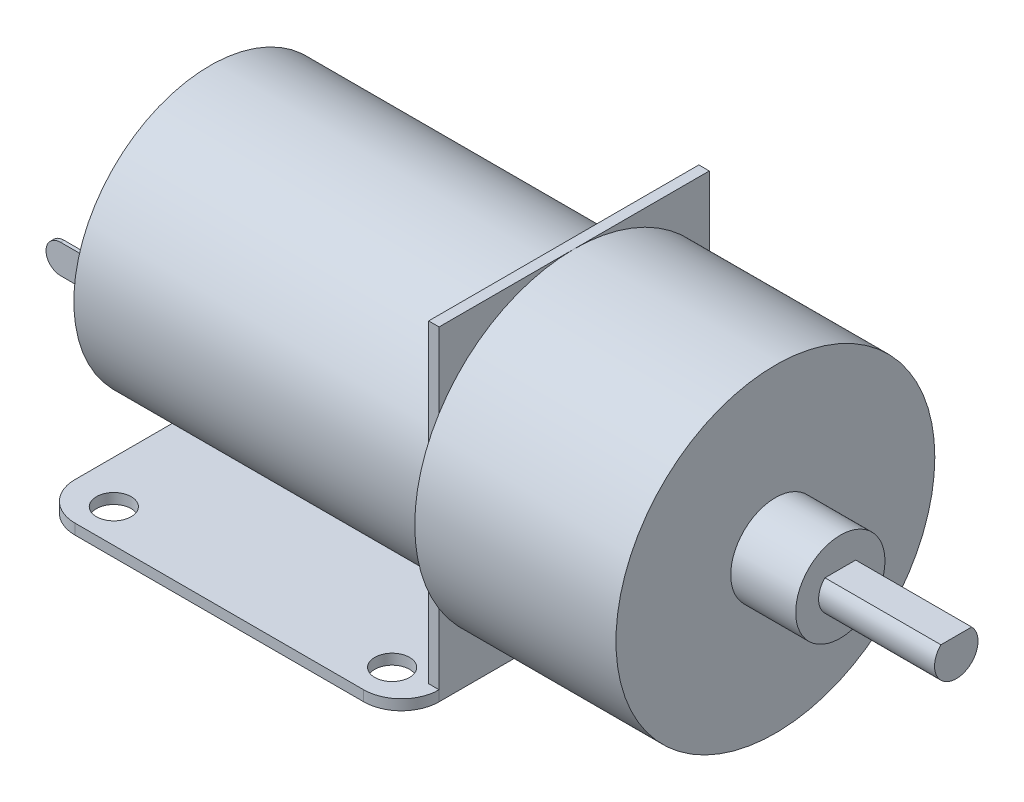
ISO-10303-21;
HEADER;
FILE_DESCRIPTION(('STEP AP214'),'2;1');
FILE_NAME('part.step','',(''),(''),'','','');
FILE_SCHEMA(('AUTOMOTIVE_DESIGN { 1 0 10303 214 1 1 1 1 }'));
ENDSEC;
DATA;
#1=APPLICATION_CONTEXT('core data for automotive mechanical design processes');
#2=APPLICATION_PROTOCOL_DEFINITION('international standard','automotive_design',2000,#1);
#3=PRODUCT_CONTEXT('',#1,'mechanical');
#4=PRODUCT('Part','Part','',(#3));
#5=PRODUCT_RELATED_PRODUCT_CATEGORY('part','',(#4));
#6=PRODUCT_DEFINITION_FORMATION('','',#4);
#7=PRODUCT_DEFINITION_CONTEXT('part definition',#1,'design');
#8=PRODUCT_DEFINITION('design','',#6,#7);
#9=PRODUCT_DEFINITION_SHAPE('','',#8);
#10=(LENGTH_UNIT() NAMED_UNIT(*) SI_UNIT(.MILLI.,.METRE.));
#11=(NAMED_UNIT(*) PLANE_ANGLE_UNIT() SI_UNIT($,.RADIAN.));
#12=(NAMED_UNIT(*) SI_UNIT($,.STERADIAN.) SOLID_ANGLE_UNIT());
#13=UNCERTAINTY_MEASURE_WITH_UNIT(LENGTH_MEASURE(1.E-05),#10,'distance_accuracy_value','');
#14=(GEOMETRIC_REPRESENTATION_CONTEXT(3) GLOBAL_UNCERTAINTY_ASSIGNED_CONTEXT((#13)) GLOBAL_UNIT_ASSIGNED_CONTEXT((#10,
#11,#12)) REPRESENTATION_CONTEXT('',''));
#15=CARTESIAN_POINT('',(0.,0.,0.));
#16=DIRECTION('',(0.,0.,1.));
#17=DIRECTION('',(1.,0.,0.));
#18=AXIS2_PLACEMENT_3D('',#15,#16,#17);
#19=CARTESIAN_POINT('',(-48.75,0.,0.));
#20=DIRECTION('',(-1.,0.,0.));
#21=DIRECTION('',(0.,0.,1.));
#22=AXIS2_PLACEMENT_3D('',#19,#20,#21);
#23=PLANE('',#22);
#24=CARTESIAN_POINT('',(-48.75,0.,0.));
#25=DIRECTION('',(1.,0.,0.));
#26=DIRECTION('',(0.,0.,-1.));
#27=AXIS2_PLACEMENT_3D('',#24,#25,#26);
#28=CIRCLE('',#27,11.75);
#29=CARTESIAN_POINT('',(-48.75,0.,-11.75));
#30=VERTEX_POINT('',#29);
#31=EDGE_CURVE('E448',#30,#30,#28,.T.);
#32=ORIENTED_EDGE('',*,*,#31,.F.);
#33=EDGE_LOOP('',(#32));
#34=FACE_BOUND('',#33,.T.);
#35=DIRECTION('',(0.,0.,-1.));
#36=VECTOR('',#35,1.);
#37=CARTESIAN_POINT('',(-48.75,1.25,8.85));
#38=LINE('',#37,#36);
#39=CARTESIAN_POINT('',(-48.75,1.25,9.15));
#40=VERTEX_POINT('',#39);
#41=CARTESIAN_POINT('',(-48.75,1.25,8.85));
#42=VERTEX_POINT('',#41);
#43=EDGE_CURVE('E265',#40,#42,#38,.T.);
#44=ORIENTED_EDGE('',*,*,#43,.F.);
#45=DIRECTION('',(0.,1.,0.));
#46=VECTOR('',#45,1.);
#47=CARTESIAN_POINT('',(-48.75,-1.25,9.15));
#48=LINE('',#47,#46);
#49=CARTESIAN_POINT('',(-48.75,-1.25,9.15));
#50=VERTEX_POINT('',#49);
#51=EDGE_CURVE('E260',#50,#40,#48,.T.);
#52=ORIENTED_EDGE('',*,*,#51,.F.);
#53=DIRECTION('',(0.,0.,1.));
#54=VECTOR('',#53,1.);
#55=CARTESIAN_POINT('',(-48.75,-1.25,8.85));
#56=LINE('',#55,#54);
#57=CARTESIAN_POINT('',(-48.75,-1.25,8.85));
#58=VERTEX_POINT('',#57);
#59=EDGE_CURVE('E277',#58,#50,#56,.T.);
#60=ORIENTED_EDGE('',*,*,#59,.F.);
#61=DIRECTION('',(0.,-1.,0.));
#62=VECTOR('',#61,1.);
#63=CARTESIAN_POINT('',(-48.75,-1.25,8.85));
#64=LINE('',#63,#62);
#65=EDGE_CURVE('E273',#42,#58,#64,.T.);
#66=ORIENTED_EDGE('',*,*,#65,.F.);
#67=EDGE_LOOP('',(#44,#52,#60,#66));
#68=FACE_BOUND('',#67,.T.);
#69=DIRECTION('',(0.,0.,-1.));
#70=VECTOR('',#69,1.);
#71=CARTESIAN_POINT('',(-48.75,1.25,-8.85));
#72=LINE('',#71,#70);
#73=CARTESIAN_POINT('',(-48.75,1.25,-8.85));
#74=VERTEX_POINT('',#73);
#75=CARTESIAN_POINT('',(-48.75,1.25,-9.15));
#76=VERTEX_POINT('',#75);
#77=EDGE_CURVE('E258',#74,#76,#72,.T.);
#78=ORIENTED_EDGE('',*,*,#77,.F.);
#79=DIRECTION('',(0.,1.,0.));
#80=VECTOR('',#79,1.);
#81=CARTESIAN_POINT('',(-48.75,-1.25,-8.85));
#82=LINE('',#81,#80);
#83=CARTESIAN_POINT('',(-48.75,-1.25,-8.85));
#84=VERTEX_POINT('',#83);
#85=EDGE_CURVE('E238',#84,#74,#82,.T.);
#86=ORIENTED_EDGE('',*,*,#85,.F.);
#87=DIRECTION('',(0.,0.,1.));
#88=VECTOR('',#87,1.);
#89=CARTESIAN_POINT('',(-48.75,-1.25,-8.85));
#90=LINE('',#89,#88);
#91=CARTESIAN_POINT('',(-48.75,-1.25,-9.15));
#92=VERTEX_POINT('',#91);
#93=EDGE_CURVE('E245',#92,#84,#90,.T.);
#94=ORIENTED_EDGE('',*,*,#93,.F.);
#95=DIRECTION('',(0.,-1.,0.));
#96=VECTOR('',#95,1.);
#97=CARTESIAN_POINT('',(-48.75,-1.25,-9.15));
#98=LINE('',#97,#96);
#99=EDGE_CURVE('E255',#76,#92,#98,.T.);
#100=ORIENTED_EDGE('',*,*,#99,.F.);
#101=EDGE_LOOP('',(#78,#86,#94,#100));
#102=FACE_BOUND('',#101,.T.);
#103=ADVANCED_FACE('F52',(#34,#68,#102),#23,.T.);
#104=CARTESIAN_POINT('',(0.,0.,0.));
#105=DIRECTION('',(1.,0.,0.));
#106=DIRECTION('',(0.,0.,-1.));
#107=AXIS2_PLACEMENT_3D('',#104,#105,#106);
#108=CYLINDRICAL_SURFACE('',#107,1.875);
#109=CARTESIAN_POINT('',(15.6,0.,0.));
#110=DIRECTION('',(1.,0.,0.));
#111=DIRECTION('',(0.,0.,-1.));
#112=AXIS2_PLACEMENT_3D('',#109,#110,#111);
#113=CIRCLE('',#112,1.875);
#114=CARTESIAN_POINT('',(15.6,1.325,1.32664991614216));
#115=VERTEX_POINT('',#114);
#116=CARTESIAN_POINT('',(15.6,1.325,-1.32664991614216));
#117=VERTEX_POINT('',#116);
#118=EDGE_CURVE('E423',#115,#117,#113,.T.);
#119=ORIENTED_EDGE('',*,*,#118,.F.);
#120=DIRECTION('',(1.,0.,0.));
#121=VECTOR('',#120,1.);
#122=CARTESIAN_POINT('',(-35.6994915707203,1.325,1.32664991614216));
#123=LINE('',#122,#121);
#124=CARTESIAN_POINT('',(5.6,1.325,1.32664991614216));
#125=VERTEX_POINT('',#124);
#126=EDGE_CURVE('E298',#125,#115,#123,.T.);
#127=ORIENTED_EDGE('',*,*,#126,.F.);
#128=CARTESIAN_POINT('',(5.6,0.,0.));
#129=DIRECTION('',(1.,0.,0.));
#130=DIRECTION('',(0.,0.,-1.));
#131=AXIS2_PLACEMENT_3D('',#128,#129,#130);
#132=CIRCLE('',#131,1.875);
#133=CARTESIAN_POINT('',(5.6,1.325,-1.32664991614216));
#134=VERTEX_POINT('',#133);
#135=EDGE_CURVE('E427',#125,#134,#132,.T.);
#136=ORIENTED_EDGE('',*,*,#135,.T.);
#137=DIRECTION('',(1.,0.,0.));
#138=VECTOR('',#137,1.);
#139=CARTESIAN_POINT('',(-35.6994915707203,1.325,-1.32664991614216));
#140=LINE('',#139,#138);
#141=EDGE_CURVE('E297',#134,#117,#140,.T.);
#142=ORIENTED_EDGE('',*,*,#141,.T.);
#143=EDGE_LOOP('',(#119,#127,#136,#142));
#144=FACE_BOUND('',#143,.T.);
#145=ADVANCED_FACE('F595',(#144),#108,.T.);
#146=CARTESIAN_POINT('',(15.6,1.875,0.));
#147=DIRECTION('',(1.,0.,0.));
#148=DIRECTION('',(0.,0.,-1.));
#149=AXIS2_PLACEMENT_3D('',#146,#147,#148);
#150=PLANE('',#149);
#151=ORIENTED_EDGE('',*,*,#118,.T.);
#152=DIRECTION('',(0.,0.,1.));
#153=VECTOR('',#152,1.);
#154=CARTESIAN_POINT('',(15.6,1.325,1.32664991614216));
#155=LINE('',#154,#153);
#156=EDGE_CURVE('E293',#117,#115,#155,.T.);
#157=ORIENTED_EDGE('',*,*,#156,.T.);
#158=EDGE_LOOP('',(#151,#157));
#159=FACE_BOUND('',#158,.T.);
#160=ADVANCED_FACE('F602',(#159),#150,.T.);
#161=CARTESIAN_POINT('',(-17.35,13.75,14.9));
#162=DIRECTION('',(1.,0.,0.));
#163=DIRECTION('',(0.,0.,-1.));
#164=AXIS2_PLACEMENT_3D('',#161,#162,#163);
#165=PLANE('',#164);
#166=DIRECTION('',(0.,0.,-1.));
#167=VECTOR('',#166,1.);
#168=CARTESIAN_POINT('',(-17.35,-14.25,14.9));
#169=LINE('',#168,#167);
#170=CARTESIAN_POINT('',(-17.35,-14.25,11.65));
#171=VERTEX_POINT('',#170);
#172=CARTESIAN_POINT('',(-17.35,-14.25,-11.65));
#173=VERTEX_POINT('',#172);
#174=EDGE_CURVE('E411',#171,#173,#169,.T.);
#175=ORIENTED_EDGE('',*,*,#174,.T.);
#176=DIRECTION('',(0.,-1.,0.));
#177=VECTOR('',#176,1.);
#178=CARTESIAN_POINT('',(-17.35,13.75,-11.65));
#179=LINE('',#178,#177);
#180=CARTESIAN_POINT('',(-17.35,-13.35,-11.65));
#181=VERTEX_POINT('',#180);
#182=EDGE_CURVE('E510',#173,#181,#179,.F.);
#183=ORIENTED_EDGE('',*,*,#182,.T.);
#184=DIRECTION('',(0.,1.,0.));
#185=VECTOR('',#184,1.);
#186=CARTESIAN_POINT('',(-17.35,13.75,-11.65));
#187=LINE('',#186,#185);
#188=CARTESIAN_POINT('',(-17.35,-7.30342385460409,-11.65));
#189=VERTEX_POINT('',#188);
#190=EDGE_CURVE('E341',#181,#189,#187,.T.);
#191=ORIENTED_EDGE('',*,*,#190,.T.);
#192=CARTESIAN_POINT('',(-17.35,0.,0.));
#193=DIRECTION('',(1.,0.,0.));
#194=DIRECTION('',(0.,0.,-1.));
#195=AXIS2_PLACEMENT_3D('',#192,#193,#194);
#196=CIRCLE('',#195,13.75);
#197=CARTESIAN_POINT('',(-17.35,-7.30342385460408,11.65));
#198=VERTEX_POINT('',#197);
#199=EDGE_CURVE('E459',#189,#198,#196,.F.);
#200=ORIENTED_EDGE('',*,*,#199,.T.);
#201=DIRECTION('',(0.,1.,0.));
#202=VECTOR('',#201,1.);
#203=CARTESIAN_POINT('',(-17.35,13.75,11.65));
#204=LINE('',#203,#202);
#205=CARTESIAN_POINT('',(-17.35,-13.35,11.65));
#206=VERTEX_POINT('',#205);
#207=EDGE_CURVE('E362',#206,#198,#204,.T.);
#208=ORIENTED_EDGE('',*,*,#207,.F.);
#209=DIRECTION('',(0.,-1.,0.));
#210=VECTOR('',#209,1.);
#211=CARTESIAN_POINT('',(-17.35,-14.25,11.65));
#212=LINE('',#211,#210);
#213=EDGE_CURVE('E506',#206,#171,#212,.T.);
#214=ORIENTED_EDGE('',*,*,#213,.T.);
#215=EDGE_LOOP('',(#175,#183,#191,#200,#208,#214));
#216=FACE_BOUND('',#215,.T.);
#217=ADVANCED_FACE('F746',(#216),#165,.T.);
#218=CARTESIAN_POINT('',(-17.35,13.75,0.));
#219=VERTEX_POINT('',#218);
#220=CARTESIAN_POINT('',(-17.35,7.30342385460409,-11.65));
#221=VERTEX_POINT('',#220);
#222=EDGE_CURVE('E454',#219,#221,#196,.F.);
#223=ORIENTED_EDGE('',*,*,#222,.T.);
#224=CARTESIAN_POINT('',(-17.35,13.75,-11.65));
#225=VERTEX_POINT('',#224);
#226=EDGE_CURVE('E347',#221,#225,#187,.T.);
#227=ORIENTED_EDGE('',*,*,#226,.T.);
#228=DIRECTION('',(0.,0.,-1.));
#229=VECTOR('',#228,1.);
#230=CARTESIAN_POINT('',(-17.35,13.75,14.9));
#231=LINE('',#230,#229);
#232=EDGE_CURVE('E407',#219,#225,#231,.T.);
#233=ORIENTED_EDGE('',*,*,#232,.F.);
#234=EDGE_LOOP('',(#223,#227,#233));
#235=FACE_BOUND('',#234,.T.);
#236=ADVANCED_FACE('F843',(#235),#165,.T.);
#237=CARTESIAN_POINT('',(-18.25,13.75,14.9));
#238=DIRECTION('',(0.,1.,0.));
#239=DIRECTION('',(0.,0.,1.));
#240=AXIS2_PLACEMENT_3D('',#237,#238,#239);
#241=PLANE('',#240);
#242=ORIENTED_EDGE('',*,*,#232,.T.);
#243=DIRECTION('',(1.,0.,0.));
#244=VECTOR('',#243,1.);
#245=CARTESIAN_POINT('',(-45.544184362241,13.75,-11.65));
#246=LINE('',#245,#244);
#247=CARTESIAN_POINT('',(-18.25,13.75,-11.65));
#248=VERTEX_POINT('',#247);
#249=EDGE_CURVE('E345',#248,#225,#246,.T.);
#250=ORIENTED_EDGE('',*,*,#249,.F.);
#251=DIRECTION('',(0.,0.,-1.));
#252=VECTOR('',#251,1.);
#253=CARTESIAN_POINT('',(-18.25,13.75,14.9));
#254=LINE('',#253,#252);
#255=CARTESIAN_POINT('',(-18.25,13.75,11.65));
#256=VERTEX_POINT('',#255);
#257=EDGE_CURVE('E403',#256,#248,#254,.T.);
#258=ORIENTED_EDGE('',*,*,#257,.F.);
#259=DIRECTION('',(1.,0.,0.));
#260=VECTOR('',#259,1.);
#261=CARTESIAN_POINT('',(-45.544184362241,13.75,11.65));
#262=LINE('',#261,#260);
#263=CARTESIAN_POINT('',(-17.35,13.75,11.65));
#264=VERTEX_POINT('',#263);
#265=EDGE_CURVE('E372',#256,#264,#262,.T.);
#266=ORIENTED_EDGE('',*,*,#265,.T.);
#267=EDGE_CURVE('E408',#264,#219,#231,.T.);
#268=ORIENTED_EDGE('',*,*,#267,.T.);
#269=EDGE_LOOP('',(#242,#250,#258,#266,#268));
#270=FACE_BOUND('',#269,.T.);
#271=ADVANCED_FACE('F852',(#270),#241,.T.);
#272=CARTESIAN_POINT('',(0.,0.,-14.9));
#273=DIRECTION('',(0.,0.,-1.));
#274=DIRECTION('',(-1.,0.,0.));
#275=AXIS2_PLACEMENT_3D('',#272,#273,#274);
#276=PLANE('',#275);
#277=DIRECTION('',(-1.,0.,0.));
#278=VECTOR('',#277,1.);
#279=CARTESIAN_POINT('',(-17.35,-14.25,-14.9));
#280=LINE('',#279,#278);
#281=CARTESIAN_POINT('',(-20.6,-14.25,-14.9));
#282=VERTEX_POINT('',#281);
#283=CARTESIAN_POINT('',(-45.5,-14.25,-14.9));
#284=VERTEX_POINT('',#283);
#285=EDGE_CURVE('E389',#282,#284,#280,.T.);
#286=ORIENTED_EDGE('',*,*,#285,.T.);
#287=DIRECTION('',(0.,1.,0.));
#288=VECTOR('',#287,1.);
#289=CARTESIAN_POINT('',(-45.5,0.,-14.9));
#290=LINE('',#289,#288);
#291=CARTESIAN_POINT('',(-45.5,-13.35,-14.9));
#292=VERTEX_POINT('',#291);
#293=EDGE_CURVE('E471',#284,#292,#290,.T.);
#294=ORIENTED_EDGE('',*,*,#293,.T.);
#295=DIRECTION('',(-1.,0.,0.));
#296=VECTOR('',#295,1.);
#297=CARTESIAN_POINT('',(-17.35,-13.35,-14.9));
#298=LINE('',#297,#296);
#299=CARTESIAN_POINT('',(-20.6,-13.35,-14.9));
#300=VERTEX_POINT('',#299);
#301=EDGE_CURVE('E383',#300,#292,#298,.T.);
#302=ORIENTED_EDGE('',*,*,#301,.F.);
#303=DIRECTION('',(0.,-1.,0.));
#304=VECTOR('',#303,1.);
#305=CARTESIAN_POINT('',(-20.6,0.,-14.9));
#306=LINE('',#305,#304);
#307=EDGE_CURVE('E467',#300,#282,#306,.T.);
#308=ORIENTED_EDGE('',*,*,#307,.T.);
#309=EDGE_LOOP('',(#286,#294,#302,#308));
#310=FACE_BOUND('',#309,.T.);
#311=ADVANCED_FACE('F860',(#310),#276,.T.);
#312=CARTESIAN_POINT('',(-18.25,11.75,0.));
#313=DIRECTION('',(-1.,0.,0.));
#314=DIRECTION('',(0.,0.,1.));
#315=AXIS2_PLACEMENT_3D('',#312,#313,#314);
#316=PLANE('',#315);
#317=ORIENTED_EDGE('',*,*,#257,.T.);
#318=DIRECTION('',(0.,-1.,0.));
#319=VECTOR('',#318,1.);
#320=CARTESIAN_POINT('',(-18.25,11.75,-11.65));
#321=LINE('',#320,#319);
#322=CARTESIAN_POINT('',(-18.25,1.5297058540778,-11.65));
#323=VERTEX_POINT('',#322);
#324=EDGE_CURVE('E463',#248,#323,#321,.T.);
#325=ORIENTED_EDGE('',*,*,#324,.T.);
#326=CARTESIAN_POINT('',(-18.25,0.,0.));
#327=DIRECTION('',(1.,0.,0.));
#328=DIRECTION('',(0.,0.,-1.));
#329=AXIS2_PLACEMENT_3D('',#326,#327,#328);
#330=CIRCLE('',#329,11.75);
#331=CARTESIAN_POINT('',(-18.25,1.5297058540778,11.65));
#332=VERTEX_POINT('',#331);
#333=EDGE_CURVE('E443',#323,#332,#330,.T.);
#334=ORIENTED_EDGE('',*,*,#333,.T.);
#335=DIRECTION('',(0.,-1.,0.));
#336=VECTOR('',#335,1.);
#337=CARTESIAN_POINT('',(-18.25,11.75,11.65));
#338=LINE('',#337,#336);
#339=EDGE_CURVE('E458',#256,#332,#338,.T.);
#340=ORIENTED_EDGE('',*,*,#339,.F.);
#341=EDGE_LOOP('',(#317,#325,#334,#340));
#342=FACE_BOUND('',#341,.T.);
#343=ADVANCED_FACE('F868',(#342),#316,.T.);
#344=CARTESIAN_POINT('',(-18.25,-1.5297058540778,11.65));
#345=VERTEX_POINT('',#344);
#346=CARTESIAN_POINT('',(-18.25,-1.5297058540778,-11.65));
#347=VERTEX_POINT('',#346);
#348=EDGE_CURVE('E449',#345,#347,#330,.T.);
#349=ORIENTED_EDGE('',*,*,#348,.T.);
#350=DIRECTION('',(0.,1.,0.));
#351=VECTOR('',#350,1.);
#352=CARTESIAN_POINT('',(-18.25,13.75,-11.65));
#353=LINE('',#352,#351);
#354=CARTESIAN_POINT('',(-18.25,-13.35,-11.65));
#355=VERTEX_POINT('',#354);
#356=EDGE_CURVE('E348',#355,#347,#353,.T.);
#357=ORIENTED_EDGE('',*,*,#356,.F.);
#358=DIRECTION('',(0.,0.,-1.));
#359=VECTOR('',#358,1.);
#360=CARTESIAN_POINT('',(-18.25,-13.35,14.9));
#361=LINE('',#360,#359);
#362=CARTESIAN_POINT('',(-18.25,-13.35,11.65));
#363=VERTEX_POINT('',#362);
#364=EDGE_CURVE('E393',#363,#355,#361,.T.);
#365=ORIENTED_EDGE('',*,*,#364,.F.);
#366=DIRECTION('',(0.,1.,0.));
#367=VECTOR('',#366,1.);
#368=CARTESIAN_POINT('',(-18.25,13.75,11.65));
#369=LINE('',#368,#367);
#370=EDGE_CURVE('E368',#363,#345,#369,.T.);
#371=ORIENTED_EDGE('',*,*,#370,.T.);
#372=EDGE_LOOP('',(#349,#357,#365,#371));
#373=FACE_BOUND('',#372,.T.);
#374=ADVANCED_FACE('F875',(#373),#316,.T.);
#375=CARTESIAN_POINT('',(0.,0.,0.));
#376=DIRECTION('',(1.,0.,0.));
#377=DIRECTION('',(0.,0.,-1.));
#378=AXIS2_PLACEMENT_3D('',#375,#376,#377);
#379=CYLINDRICAL_SURFACE('',#378,13.75);
#380=ORIENTED_EDGE('',*,*,#222,.F.);
#381=CARTESIAN_POINT('',(-17.35,7.30342385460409,11.65));
#382=VERTEX_POINT('',#381);
#383=EDGE_CURVE('E453',#382,#219,#196,.F.);
#384=ORIENTED_EDGE('',*,*,#383,.F.);
#385=CARTESIAN_POINT('',(-17.35,0.,0.));
#386=DIRECTION('',(1.,0.,0.));
#387=DIRECTION('',(0.,0.,-1.));
#388=AXIS2_PLACEMENT_3D('',#385,#386,#387);
#389=CIRCLE('',#388,13.75);
#390=EDGE_CURVE('E377',#198,#382,#389,.F.);
#391=ORIENTED_EDGE('',*,*,#390,.F.);
#392=ORIENTED_EDGE('',*,*,#199,.F.);
#393=CARTESIAN_POINT('',(-17.35,0.,0.));
#394=DIRECTION('',(1.,0.,0.));
#395=DIRECTION('',(0.,0.,-1.));
#396=AXIS2_PLACEMENT_3D('',#393,#394,#395);
#397=CIRCLE('',#396,13.75);
#398=EDGE_CURVE('E352',#221,#189,#397,.F.);
#399=ORIENTED_EDGE('',*,*,#398,.F.);
#400=EDGE_LOOP('',(#380,#384,#391,#392,#399));
#401=FACE_BOUND('',#400,.T.);
#402=CARTESIAN_POINT('',(0.,0.,0.));
#403=DIRECTION('',(1.,0.,0.));
#404=DIRECTION('',(0.,0.,-1.));
#405=AXIS2_PLACEMENT_3D('',#402,#403,#404);
#406=CIRCLE('',#405,13.75);
#407=CARTESIAN_POINT('',(0.,0.,-13.75));
#408=VERTEX_POINT('',#407);
#409=EDGE_CURVE('E439',#408,#408,#406,.T.);
#410=ORIENTED_EDGE('',*,*,#409,.F.);
#411=EDGE_LOOP('',(#410));
#412=FACE_BOUND('',#411,.T.);
#413=ADVANCED_FACE('F884',(#401,#412),#379,.T.);
#414=CARTESIAN_POINT('',(0.,13.75,0.));
#415=DIRECTION('',(1.,0.,0.));
#416=DIRECTION('',(0.,0.,-1.));
#417=AXIS2_PLACEMENT_3D('',#414,#415,#416);
#418=PLANE('',#417);
#419=ORIENTED_EDGE('',*,*,#409,.T.);
#420=EDGE_LOOP('',(#419));
#421=FACE_BOUND('',#420,.T.);
#422=CARTESIAN_POINT('',(0.,0.,0.));
#423=DIRECTION('',(1.,0.,0.));
#424=DIRECTION('',(0.,0.,-1.));
#425=AXIS2_PLACEMENT_3D('',#422,#423,#424);
#426=CIRCLE('',#425,3.85);
#427=CARTESIAN_POINT('',(0.,0.,-3.85));
#428=VERTEX_POINT('',#427);
#429=EDGE_CURVE('E435',#428,#428,#426,.T.);
#430=ORIENTED_EDGE('',*,*,#429,.F.);
#431=EDGE_LOOP('',(#430));
#432=FACE_BOUND('',#431,.T.);
#433=ADVANCED_FACE('F892',(#421,#432),#418,.T.);
#434=CARTESIAN_POINT('',(0.,0.,0.));
#435=DIRECTION('',(1.,0.,0.));
#436=DIRECTION('',(0.,0.,-1.));
#437=AXIS2_PLACEMENT_3D('',#434,#435,#436);
#438=CYLINDRICAL_SURFACE('',#437,3.85);
#439=ORIENTED_EDGE('',*,*,#429,.T.);
#440=EDGE_LOOP('',(#439));
#441=FACE_BOUND('',#440,.T.);
#442=CARTESIAN_POINT('',(5.6,0.,0.));
#443=DIRECTION('',(1.,0.,0.));
#444=DIRECTION('',(0.,0.,-1.));
#445=AXIS2_PLACEMENT_3D('',#442,#443,#444);
#446=CIRCLE('',#445,3.85);
#447=CARTESIAN_POINT('',(5.6,0.,-3.85));
#448=VERTEX_POINT('',#447);
#449=EDGE_CURVE('E431',#448,#448,#446,.T.);
#450=ORIENTED_EDGE('',*,*,#449,.F.);
#451=EDGE_LOOP('',(#450));
#452=FACE_BOUND('',#451,.T.);
#453=ADVANCED_FACE('F730',(#441,#452),#438,.T.);
#454=CARTESIAN_POINT('',(5.6,3.85,0.));
#455=DIRECTION('',(1.,0.,0.));
#456=DIRECTION('',(0.,0.,-1.));
#457=AXIS2_PLACEMENT_3D('',#454,#455,#456);
#458=PLANE('',#457);
#459=ORIENTED_EDGE('',*,*,#449,.T.);
#460=EDGE_LOOP('',(#459));
#461=FACE_BOUND('',#460,.T.);
#462=ORIENTED_EDGE('',*,*,#135,.F.);
#463=DIRECTION('',(0.,0.,-1.));
#464=VECTOR('',#463,1.);
#465=CARTESIAN_POINT('',(5.6,1.325,1.32664991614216));
#466=LINE('',#465,#464);
#467=EDGE_CURVE('E301',#125,#134,#466,.T.);
#468=ORIENTED_EDGE('',*,*,#467,.T.);
#469=EDGE_LOOP('',(#462,#468));
#470=FACE_BOUND('',#469,.T.);
#471=ADVANCED_FACE('F724',(#461,#470),#458,.T.);
#472=CARTESIAN_POINT('',(-17.35,-13.35,14.9));
#473=DIRECTION('',(0.,-1.,0.));
#474=DIRECTION('',(1.,0.,0.));
#475=AXIS2_PLACEMENT_3D('',#472,#473,#474);
#476=PLANE('',#475);
#477=CARTESIAN_POINT('',(-45.05,-13.35,12.));
#478=DIRECTION('',(0.,-1.,0.));
#479=DIRECTION('',(1.,0.,0.));
#480=AXIS2_PLACEMENT_3D('',#477,#478,#479);
#481=CIRCLE('',#480,1.5);
#482=CARTESIAN_POINT('',(-43.55,-13.35,12.));
#483=VERTEX_POINT('',#482);
#484=EDGE_CURVE('E312',#483,#483,#481,.T.);
#485=ORIENTED_EDGE('',*,*,#484,.T.);
#486=EDGE_LOOP('',(#485));
#487=FACE_BOUND('',#486,.T.);
#488=CARTESIAN_POINT('',(-21.05,-13.35,12.));
#489=DIRECTION('',(0.,-1.,0.));
#490=DIRECTION('',(1.,0.,0.));
#491=AXIS2_PLACEMENT_3D('',#488,#489,#490);
#492=CIRCLE('',#491,1.5);
#493=CARTESIAN_POINT('',(-19.55,-13.35,12.));
#494=VERTEX_POINT('',#493);
#495=EDGE_CURVE('E320',#494,#494,#492,.T.);
#496=ORIENTED_EDGE('',*,*,#495,.T.);
#497=EDGE_LOOP('',(#496));
#498=FACE_BOUND('',#497,.T.);
#499=CARTESIAN_POINT('',(-45.05,-13.35,-12.));
#500=DIRECTION('',(0.,-1.,0.));
#501=DIRECTION('',(1.,0.,0.));
#502=AXIS2_PLACEMENT_3D('',#499,#500,#501);
#503=CIRCLE('',#502,1.5);
#504=CARTESIAN_POINT('',(-43.55,-13.35,-12.));
#505=VERTEX_POINT('',#504);
#506=EDGE_CURVE('E328',#505,#505,#503,.T.);
#507=ORIENTED_EDGE('',*,*,#506,.T.);
#508=EDGE_LOOP('',(#507));
#509=FACE_BOUND('',#508,.T.);
#510=CARTESIAN_POINT('',(-21.05,-13.35,-12.));
#511=DIRECTION('',(0.,-1.,0.));
#512=DIRECTION('',(1.,0.,0.));
#513=AXIS2_PLACEMENT_3D('',#510,#511,#512);
#514=CIRCLE('',#513,1.5);
#515=CARTESIAN_POINT('',(-19.55,-13.35,-12.));
#516=VERTEX_POINT('',#515);
#517=EDGE_CURVE('E336',#516,#516,#514,.T.);
#518=ORIENTED_EDGE('',*,*,#517,.T.);
#519=EDGE_LOOP('',(#518));
#520=FACE_BOUND('',#519,.T.);
#521=ORIENTED_EDGE('',*,*,#301,.T.);
#522=CARTESIAN_POINT('',(-45.5,-13.35,-11.65));
#523=DIRECTION('',(0.,-1.,0.));
#524=DIRECTION('',(1.,0.,0.));
#525=AXIS2_PLACEMENT_3D('',#522,#523,#524);
#526=CIRCLE('',#525,3.25);
#527=CARTESIAN_POINT('',(-48.75,-13.35,-11.65));
#528=VERTEX_POINT('',#527);
#529=EDGE_CURVE('E484',#292,#528,#526,.F.);
#530=ORIENTED_EDGE('',*,*,#529,.T.);
#531=DIRECTION('',(0.,0.,-1.));
#532=VECTOR('',#531,1.);
#533=CARTESIAN_POINT('',(-48.75,-13.35,14.9));
#534=LINE('',#533,#532);
#535=CARTESIAN_POINT('',(-48.75,-13.35,11.65));
#536=VERTEX_POINT('',#535);
#537=EDGE_CURVE('E419',#536,#528,#534,.T.);
#538=ORIENTED_EDGE('',*,*,#537,.F.);
#539=CARTESIAN_POINT('',(-45.5,-13.35,11.65));
#540=DIRECTION('',(0.,-1.,0.));
#541=DIRECTION('',(1.,0.,0.));
#542=AXIS2_PLACEMENT_3D('',#539,#540,#541);
#543=CIRCLE('',#542,3.25);
#544=CARTESIAN_POINT('',(-45.5,-13.35,14.9));
#545=VERTEX_POINT('',#544);
#546=EDGE_CURVE('E478',#536,#545,#543,.F.);
#547=ORIENTED_EDGE('',*,*,#546,.T.);
#548=DIRECTION('',(-1.,0.,0.));
#549=VECTOR('',#548,1.);
#550=CARTESIAN_POINT('',(-17.35,-13.35,14.9));
#551=LINE('',#550,#549);
#552=CARTESIAN_POINT('',(-20.6,-13.35,14.9));
#553=VERTEX_POINT('',#552);
#554=EDGE_CURVE('E384',#553,#545,#551,.T.);
#555=ORIENTED_EDGE('',*,*,#554,.F.);
#556=CARTESIAN_POINT('',(-20.6,-13.35,11.65));
#557=DIRECTION('',(0.,-1.,0.));
#558=DIRECTION('',(1.,0.,0.));
#559=AXIS2_PLACEMENT_3D('',#556,#557,#558);
#560=CIRCLE('',#559,3.25);
#561=EDGE_CURVE('E475',#553,#206,#560,.F.);
#562=ORIENTED_EDGE('',*,*,#561,.T.);
#563=DIRECTION('',(1.,0.,0.));
#564=VECTOR('',#563,1.);
#565=CARTESIAN_POINT('',(-45.544184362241,-13.35,11.65));
#566=LINE('',#565,#564);
#567=EDGE_CURVE('E366',#363,#206,#566,.T.);
#568=ORIENTED_EDGE('',*,*,#567,.F.);
#569=ORIENTED_EDGE('',*,*,#364,.T.);
#570=DIRECTION('',(1.,0.,0.));
#571=VECTOR('',#570,1.);
#572=CARTESIAN_POINT('',(-45.544184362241,-13.35,-11.65));
#573=LINE('',#572,#571);
#574=EDGE_CURVE('E340',#355,#181,#573,.T.);
#575=ORIENTED_EDGE('',*,*,#574,.T.);
#576=CARTESIAN_POINT('',(-20.6,-13.35,-11.65));
#577=DIRECTION('',(0.,-1.,0.));
#578=DIRECTION('',(1.,0.,0.));
#579=AXIS2_PLACEMENT_3D('',#576,#577,#578);
#580=CIRCLE('',#579,3.25);
#581=EDGE_CURVE('E481',#181,#300,#580,.F.);
#582=ORIENTED_EDGE('',*,*,#581,.T.);
#583=EDGE_LOOP('',(#521,#530,#538,#547,#555,#562,#568,#569,#575,#582));
#584=FACE_BOUND('',#583,.T.);
#585=ADVANCED_FACE('F729',(#487,#498,#509,#520,#584),#476,.F.);
#586=CARTESIAN_POINT('',(-48.75,-14.25,14.9));
#587=DIRECTION('',(-1.,0.,0.));
#588=DIRECTION('',(0.,0.,1.));
#589=AXIS2_PLACEMENT_3D('',#586,#587,#588);
#590=PLANE('',#589);
#591=ORIENTED_EDGE('',*,*,#537,.T.);
#592=DIRECTION('',(0.,1.,0.));
#593=VECTOR('',#592,1.);
#594=CARTESIAN_POINT('',(-48.75,-14.25,-11.65));
#595=LINE('',#594,#593);
#596=CARTESIAN_POINT('',(-48.75,-14.25,-11.65));
#597=VERTEX_POINT('',#596);
#598=EDGE_CURVE('E491',#528,#597,#595,.F.);
#599=ORIENTED_EDGE('',*,*,#598,.T.);
#600=DIRECTION('',(0.,0.,-1.));
#601=VECTOR('',#600,1.);
#602=CARTESIAN_POINT('',(-48.75,-14.25,14.9));
#603=LINE('',#602,#601);
#604=CARTESIAN_POINT('',(-48.75,-14.25,11.65));
#605=VERTEX_POINT('',#604);
#606=EDGE_CURVE('E415',#605,#597,#603,.T.);
#607=ORIENTED_EDGE('',*,*,#606,.F.);
#608=DIRECTION('',(0.,1.,0.));
#609=VECTOR('',#608,1.);
#610=CARTESIAN_POINT('',(-48.75,-13.35,11.65));
#611=LINE('',#610,#609);
#612=EDGE_CURVE('E487',#605,#536,#611,.T.);
#613=ORIENTED_EDGE('',*,*,#612,.T.);
#614=EDGE_LOOP('',(#591,#599,#607,#613));
#615=FACE_BOUND('',#614,.T.);
#616=ADVANCED_FACE('F830',(#615),#590,.T.);
#617=CARTESIAN_POINT('',(-17.35,-14.25,14.9));
#618=DIRECTION('',(0.,-1.,0.));
#619=DIRECTION('',(1.,0.,0.));
#620=AXIS2_PLACEMENT_3D('',#617,#618,#619);
#621=PLANE('',#620);
#622=CARTESIAN_POINT('',(-45.05,-14.25,12.));
#623=DIRECTION('',(0.,-1.,0.));
#624=DIRECTION('',(0.,0.,-1.));
#625=AXIS2_PLACEMENT_3D('',#622,#623,#624);
#626=CIRCLE('',#625,1.5);
#627=CARTESIAN_POINT('',(-45.05,-14.25,10.5));
#628=VERTEX_POINT('',#627);
#629=EDGE_CURVE('E308',#628,#628,#626,.T.);
#630=ORIENTED_EDGE('',*,*,#629,.F.);
#631=EDGE_LOOP('',(#630));
#632=FACE_BOUND('',#631,.T.);
#633=CARTESIAN_POINT('',(-21.05,-14.25,12.));
#634=DIRECTION('',(0.,-1.,0.));
#635=DIRECTION('',(0.,0.,-1.));
#636=AXIS2_PLACEMENT_3D('',#633,#634,#635);
#637=CIRCLE('',#636,1.5);
#638=CARTESIAN_POINT('',(-21.05,-14.25,10.5));
#639=VERTEX_POINT('',#638);
#640=EDGE_CURVE('E316',#639,#639,#637,.T.);
#641=ORIENTED_EDGE('',*,*,#640,.F.);
#642=EDGE_LOOP('',(#641));
#643=FACE_BOUND('',#642,.T.);
#644=CARTESIAN_POINT('',(-45.05,-14.25,-12.));
#645=DIRECTION('',(0.,-1.,0.));
#646=DIRECTION('',(0.,0.,-1.));
#647=AXIS2_PLACEMENT_3D('',#644,#645,#646);
#648=CIRCLE('',#647,1.5);
#649=CARTESIAN_POINT('',(-45.05,-14.25,-13.5));
#650=VERTEX_POINT('',#649);
#651=EDGE_CURVE('E324',#650,#650,#648,.T.);
#652=ORIENTED_EDGE('',*,*,#651,.F.);
#653=EDGE_LOOP('',(#652));
#654=FACE_BOUND('',#653,.T.);
#655=CARTESIAN_POINT('',(-21.05,-14.25,-12.));
#656=DIRECTION('',(0.,-1.,0.));
#657=DIRECTION('',(0.,0.,-1.));
#658=AXIS2_PLACEMENT_3D('',#655,#656,#657);
#659=CIRCLE('',#658,1.5);
#660=CARTESIAN_POINT('',(-21.05,-14.25,-13.5));
#661=VERTEX_POINT('',#660);
#662=EDGE_CURVE('E332',#661,#661,#659,.T.);
#663=ORIENTED_EDGE('',*,*,#662,.F.);
#664=EDGE_LOOP('',(#663));
#665=FACE_BOUND('',#664,.T.);
#666=ORIENTED_EDGE('',*,*,#606,.T.);
#667=CARTESIAN_POINT('',(-45.5,-14.25,-11.65));
#668=DIRECTION('',(0.,-1.,0.));
#669=DIRECTION('',(1.,0.,0.));
#670=AXIS2_PLACEMENT_3D('',#667,#668,#669);
#671=CIRCLE('',#670,3.25);
#672=EDGE_CURVE('E503',#597,#284,#671,.T.);
#673=ORIENTED_EDGE('',*,*,#672,.T.);
#674=ORIENTED_EDGE('',*,*,#285,.F.);
#675=CARTESIAN_POINT('',(-20.6,-14.25,-11.65));
#676=DIRECTION('',(0.,-1.,0.));
#677=DIRECTION('',(1.,0.,0.));
#678=AXIS2_PLACEMENT_3D('',#675,#676,#677);
#679=CIRCLE('',#678,3.25);
#680=EDGE_CURVE('E500',#282,#173,#679,.T.);
#681=ORIENTED_EDGE('',*,*,#680,.T.);
#682=ORIENTED_EDGE('',*,*,#174,.F.);
#683=CARTESIAN_POINT('',(-20.6,-14.25,11.65));
#684=DIRECTION('',(0.,-1.,0.));
#685=DIRECTION('',(1.,0.,0.));
#686=AXIS2_PLACEMENT_3D('',#683,#684,#685);
#687=CIRCLE('',#686,3.25);
#688=CARTESIAN_POINT('',(-20.6,-14.25,14.9));
#689=VERTEX_POINT('',#688);
#690=EDGE_CURVE('E494',#171,#689,#687,.T.);
#691=ORIENTED_EDGE('',*,*,#690,.T.);
#692=DIRECTION('',(-1.,0.,0.));
#693=VECTOR('',#692,1.);
#694=CARTESIAN_POINT('',(-17.35,-14.25,14.9));
#695=LINE('',#694,#693);
#696=CARTESIAN_POINT('',(-45.5,-14.25,14.9));
#697=VERTEX_POINT('',#696);
#698=EDGE_CURVE('E388',#689,#697,#695,.T.);
#699=ORIENTED_EDGE('',*,*,#698,.T.);
#700=CARTESIAN_POINT('',(-45.5,-14.25,11.65));
#701=DIRECTION('',(0.,-1.,0.));
#702=DIRECTION('',(1.,0.,0.));
#703=AXIS2_PLACEMENT_3D('',#700,#701,#702);
#704=CIRCLE('',#703,3.25);
#705=EDGE_CURVE('E497',#697,#605,#704,.T.);
#706=ORIENTED_EDGE('',*,*,#705,.T.);
#707=EDGE_LOOP('',(#666,#673,#674,#681,#682,#691,#699,#706));
#708=FACE_BOUND('',#707,.T.);
#709=ADVANCED_FACE('F932',(#632,#643,#654,#665,#708),#621,.T.);
#710=EDGE_CURVE('E361',#382,#264,#204,.T.);
#711=ORIENTED_EDGE('',*,*,#710,.F.);
#712=ORIENTED_EDGE('',*,*,#383,.T.);
#713=ORIENTED_EDGE('',*,*,#267,.F.);
#714=EDGE_LOOP('',(#711,#712,#713));
#715=FACE_BOUND('',#714,.T.);
#716=ADVANCED_FACE('F846',(#715),#165,.T.);
#717=CARTESIAN_POINT('',(0.,0.,14.9));
#718=DIRECTION('',(0.,0.,-1.));
#719=DIRECTION('',(-1.,0.,0.));
#720=AXIS2_PLACEMENT_3D('',#717,#718,#719);
#721=PLANE('',#720);
#722=ORIENTED_EDGE('',*,*,#554,.T.);
#723=DIRECTION('',(0.,1.,0.));
#724=VECTOR('',#723,1.);
#725=CARTESIAN_POINT('',(-45.5,-14.25,14.9));
#726=LINE('',#725,#724);
#727=EDGE_CURVE('E516',#545,#697,#726,.F.);
#728=ORIENTED_EDGE('',*,*,#727,.T.);
#729=ORIENTED_EDGE('',*,*,#698,.F.);
#730=DIRECTION('',(0.,-1.,0.));
#731=VECTOR('',#730,1.);
#732=CARTESIAN_POINT('',(-20.6,-13.35,14.9));
#733=LINE('',#732,#731);
#734=EDGE_CURVE('E513',#689,#553,#733,.F.);
#735=ORIENTED_EDGE('',*,*,#734,.T.);
#736=EDGE_LOOP('',(#722,#728,#729,#735));
#737=FACE_BOUND('',#736,.T.);
#738=ADVANCED_FACE('F903',(#737),#721,.F.);
#739=CARTESIAN_POINT('',(0.,0.,0.));
#740=DIRECTION('',(1.,0.,0.));
#741=DIRECTION('',(0.,0.,-1.));
#742=AXIS2_PLACEMENT_3D('',#739,#740,#741);
#743=CYLINDRICAL_SURFACE('',#742,11.75);
#744=ORIENTED_EDGE('',*,*,#31,.T.);
#745=EDGE_LOOP('',(#744));
#746=FACE_BOUND('',#745,.T.);
#747=EDGE_CURVE('E444',#332,#345,#330,.T.);
#748=ORIENTED_EDGE('',*,*,#747,.F.);
#749=ORIENTED_EDGE('',*,*,#333,.F.);
#750=EDGE_CURVE('E1011',#347,#323,#330,.T.);
#751=ORIENTED_EDGE('',*,*,#750,.F.);
#752=ORIENTED_EDGE('',*,*,#348,.F.);
#753=EDGE_LOOP('',(#748,#749,#751,#752));
#754=FACE_BOUND('',#753,.T.);
#755=ADVANCED_FACE('F608',(#746,#754),#743,.T.);
#756=CARTESIAN_POINT('',(-18.25,11.75,0.));
#757=DIRECTION('',(-1.,0.,0.));
#758=DIRECTION('',(0.,0.,1.));
#759=AXIS2_PLACEMENT_3D('',#756,#757,#758);
#760=PLANE('',#759);
#761=ORIENTED_EDGE('',*,*,#747,.T.);
#762=EDGE_CURVE('E373',#345,#332,#369,.T.);
#763=ORIENTED_EDGE('',*,*,#762,.T.);
#764=EDGE_LOOP('',(#761,#763));
#765=FACE_BOUND('',#764,.T.);
#766=ADVANCED_FACE('F902',(#765),#760,.F.);
#767=CARTESIAN_POINT('',(-17.35,0.,0.));
#768=DIRECTION('',(1.,0.,0.));
#769=DIRECTION('',(0.,0.,-1.));
#770=AXIS2_PLACEMENT_3D('',#767,#768,#769);
#771=PLANE('',#770);
#772=ORIENTED_EDGE('',*,*,#390,.T.);
#773=EDGE_CURVE('E367',#198,#382,#204,.T.);
#774=ORIENTED_EDGE('',*,*,#773,.F.);
#775=EDGE_LOOP('',(#772,#774));
#776=FACE_BOUND('',#775,.T.);
#777=ADVANCED_FACE('F938',(#776),#771,.F.);
#778=CARTESIAN_POINT('',(-45.544184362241,13.75,11.65));
#779=DIRECTION('',(0.,0.,-1.));
#780=DIRECTION('',(0.,1.,0.));
#781=AXIS2_PLACEMENT_3D('',#778,#779,#780);
#782=PLANE('',#781);
#783=ORIENTED_EDGE('',*,*,#567,.T.);
#784=ORIENTED_EDGE('',*,*,#207,.T.);
#785=ORIENTED_EDGE('',*,*,#773,.T.);
#786=ORIENTED_EDGE('',*,*,#710,.T.);
#787=ORIENTED_EDGE('',*,*,#265,.F.);
#788=ORIENTED_EDGE('',*,*,#339,.T.);
#789=ORIENTED_EDGE('',*,*,#762,.F.);
#790=ORIENTED_EDGE('',*,*,#370,.F.);
#791=EDGE_LOOP('',(#783,#784,#785,#786,#787,#788,#789,#790));
#792=FACE_BOUND('',#791,.T.);
#793=ADVANCED_FACE('F820',(#792),#782,.F.);
#794=CARTESIAN_POINT('',(-45.544184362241,13.75,-11.65));
#795=DIRECTION('',(0.,0.,-1.));
#796=DIRECTION('',(0.,1.,0.));
#797=AXIS2_PLACEMENT_3D('',#794,#795,#796);
#798=PLANE('',#797);
#799=ORIENTED_EDGE('',*,*,#356,.T.);
#800=EDGE_CURVE('E353',#347,#323,#353,.T.);
#801=ORIENTED_EDGE('',*,*,#800,.T.);
#802=ORIENTED_EDGE('',*,*,#324,.F.);
#803=ORIENTED_EDGE('',*,*,#249,.T.);
#804=ORIENTED_EDGE('',*,*,#226,.F.);
#805=EDGE_CURVE('E346',#189,#221,#187,.T.);
#806=ORIENTED_EDGE('',*,*,#805,.F.);
#807=ORIENTED_EDGE('',*,*,#190,.F.);
#808=ORIENTED_EDGE('',*,*,#574,.F.);
#809=EDGE_LOOP('',(#799,#801,#802,#803,#804,#806,#807,#808));
#810=FACE_BOUND('',#809,.T.);
#811=ADVANCED_FACE('F812',(#810),#798,.T.);
#812=CARTESIAN_POINT('',(-17.35,0.,0.));
#813=DIRECTION('',(1.,0.,0.));
#814=DIRECTION('',(0.,0.,1.));
#815=AXIS2_PLACEMENT_3D('',#812,#813,#814);
#816=PLANE('',#815);
#817=ORIENTED_EDGE('',*,*,#398,.T.);
#818=ORIENTED_EDGE('',*,*,#805,.T.);
#819=EDGE_LOOP('',(#817,#818));
#820=FACE_BOUND('',#819,.T.);
#821=ADVANCED_FACE('F804',(#820),#816,.F.);
#822=CARTESIAN_POINT('',(-18.25,11.75,0.));
#823=DIRECTION('',(-1.,0.,0.));
#824=DIRECTION('',(0.,0.,1.));
#825=AXIS2_PLACEMENT_3D('',#822,#823,#824);
#826=PLANE('',#825);
#827=ORIENTED_EDGE('',*,*,#750,.T.);
#828=ORIENTED_EDGE('',*,*,#800,.F.);
#829=EDGE_LOOP('',(#827,#828));
#830=FACE_BOUND('',#829,.T.);
#831=ADVANCED_FACE('F796',(#830),#826,.F.);
#832=CARTESIAN_POINT('',(-21.05,-14.25,-12.));
#833=DIRECTION('',(0.,-1.,0.));
#834=DIRECTION('',(0.,0.,-1.));
#835=AXIS2_PLACEMENT_3D('',#832,#833,#834);
#836=CYLINDRICAL_SURFACE('',#835,1.5);
#837=ORIENTED_EDGE('',*,*,#517,.F.);
#838=EDGE_LOOP('',(#837));
#839=FACE_BOUND('',#838,.T.);
#840=ORIENTED_EDGE('',*,*,#662,.T.);
#841=EDGE_LOOP('',(#840));
#842=FACE_BOUND('',#841,.T.);
#843=ADVANCED_FACE('F788',(#839,#842),#836,.F.);
#844=CARTESIAN_POINT('',(-45.05,-14.25,-12.));
#845=DIRECTION('',(0.,-1.,0.));
#846=DIRECTION('',(0.,0.,-1.));
#847=AXIS2_PLACEMENT_3D('',#844,#845,#846);
#848=CYLINDRICAL_SURFACE('',#847,1.5);
#849=ORIENTED_EDGE('',*,*,#506,.F.);
#850=EDGE_LOOP('',(#849));
#851=FACE_BOUND('',#850,.T.);
#852=ORIENTED_EDGE('',*,*,#651,.T.);
#853=EDGE_LOOP('',(#852));
#854=FACE_BOUND('',#853,.T.);
#855=ADVANCED_FACE('F780',(#851,#854),#848,.F.);
#856=CARTESIAN_POINT('',(-21.05,-14.25,12.));
#857=DIRECTION('',(0.,-1.,0.));
#858=DIRECTION('',(0.,0.,-1.));
#859=AXIS2_PLACEMENT_3D('',#856,#857,#858);
#860=CYLINDRICAL_SURFACE('',#859,1.5);
#861=ORIENTED_EDGE('',*,*,#495,.F.);
#862=EDGE_LOOP('',(#861));
#863=FACE_BOUND('',#862,.T.);
#864=ORIENTED_EDGE('',*,*,#640,.T.);
#865=EDGE_LOOP('',(#864));
#866=FACE_BOUND('',#865,.T.);
#867=ADVANCED_FACE('F771',(#863,#866),#860,.F.);
#868=CARTESIAN_POINT('',(-45.05,-14.25,12.));
#869=DIRECTION('',(0.,-1.,0.));
#870=DIRECTION('',(0.,0.,-1.));
#871=AXIS2_PLACEMENT_3D('',#868,#869,#870);
#872=CYLINDRICAL_SURFACE('',#871,1.5);
#873=ORIENTED_EDGE('',*,*,#484,.F.);
#874=EDGE_LOOP('',(#873));
#875=FACE_BOUND('',#874,.T.);
#876=ORIENTED_EDGE('',*,*,#629,.T.);
#877=EDGE_LOOP('',(#876));
#878=FACE_BOUND('',#877,.T.);
#879=ADVANCED_FACE('F614',(#875,#878),#872,.F.);
#880=CARTESIAN_POINT('',(-45.5,0.,-11.65));
#881=DIRECTION('',(0.,1.,0.));
#882=DIRECTION('',(0.,0.,1.));
#883=AXIS2_PLACEMENT_3D('',#880,#881,#882);
#884=CYLINDRICAL_SURFACE('',#883,3.25);
#885=ORIENTED_EDGE('',*,*,#672,.F.);
#886=ORIENTED_EDGE('',*,*,#598,.F.);
#887=ORIENTED_EDGE('',*,*,#529,.F.);
#888=ORIENTED_EDGE('',*,*,#293,.F.);
#889=EDGE_LOOP('',(#885,#886,#887,#888));
#890=FACE_BOUND('',#889,.T.);
#891=ADVANCED_FACE('F610',(#890),#884,.T.);
#892=CARTESIAN_POINT('',(-20.6,0.,-11.65));
#893=DIRECTION('',(0.,-1.,0.));
#894=DIRECTION('',(0.,0.,-1.));
#895=AXIS2_PLACEMENT_3D('',#892,#893,#894);
#896=CYLINDRICAL_SURFACE('',#895,3.25);
#897=ORIENTED_EDGE('',*,*,#581,.F.);
#898=ORIENTED_EDGE('',*,*,#182,.F.);
#899=ORIENTED_EDGE('',*,*,#680,.F.);
#900=ORIENTED_EDGE('',*,*,#307,.F.);
#901=EDGE_LOOP('',(#897,#898,#899,#900));
#902=FACE_BOUND('',#901,.T.);
#903=ADVANCED_FACE('F613',(#902),#896,.T.);
#904=CARTESIAN_POINT('',(-45.5,-14.25,11.65));
#905=DIRECTION('',(0.,-1.,0.));
#906=DIRECTION('',(0.,0.,-1.));
#907=AXIS2_PLACEMENT_3D('',#904,#905,#906);
#908=CYLINDRICAL_SURFACE('',#907,3.25);
#909=ORIENTED_EDGE('',*,*,#705,.F.);
#910=ORIENTED_EDGE('',*,*,#727,.F.);
#911=ORIENTED_EDGE('',*,*,#546,.F.);
#912=ORIENTED_EDGE('',*,*,#612,.F.);
#913=EDGE_LOOP('',(#909,#910,#911,#912));
#914=FACE_BOUND('',#913,.T.);
#915=ADVANCED_FACE('F618',(#914),#908,.T.);
#916=CARTESIAN_POINT('',(-20.6,13.75,11.65));
#917=DIRECTION('',(0.,1.,0.));
#918=DIRECTION('',(0.,0.,1.));
#919=AXIS2_PLACEMENT_3D('',#916,#917,#918);
#920=CYLINDRICAL_SURFACE('',#919,3.25);
#921=ORIENTED_EDGE('',*,*,#561,.F.);
#922=ORIENTED_EDGE('',*,*,#734,.F.);
#923=ORIENTED_EDGE('',*,*,#690,.F.);
#924=ORIENTED_EDGE('',*,*,#213,.F.);
#925=EDGE_LOOP('',(#921,#922,#923,#924));
#926=FACE_BOUND('',#925,.T.);
#927=ADVANCED_FACE('F622',(#926),#920,.T.);
#928=CARTESIAN_POINT('',(-35.6994915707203,1.325,1.32664991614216));
#929=DIRECTION('',(0.,1.,0.));
#930=DIRECTION('',(0.,0.,1.));
#931=AXIS2_PLACEMENT_3D('',#928,#929,#930);
#932=PLANE('',#931);
#933=ORIENTED_EDGE('',*,*,#126,.T.);
#934=ORIENTED_EDGE('',*,*,#156,.F.);
#935=ORIENTED_EDGE('',*,*,#141,.F.);
#936=ORIENTED_EDGE('',*,*,#467,.F.);
#937=EDGE_LOOP('',(#933,#934,#935,#936));
#938=FACE_BOUND('',#937,.T.);
#939=ADVANCED_FACE('F626',(#938),#932,.T.);
#940=CARTESIAN_POINT('',(-53.75,-1.25,9.15));
#941=DIRECTION('',(0.,0.,-1.));
#942=DIRECTION('',(-1.,0.,0.));
#943=AXIS2_PLACEMENT_3D('',#940,#941,#942);
#944=PLANE('',#943);
#945=CARTESIAN_POINT('',(-52.5,0.,9.15));
#946=DIRECTION('',(0.,0.,-1.));
#947=DIRECTION('',(-1.,0.,0.));
#948=AXIS2_PLACEMENT_3D('',#945,#946,#947);
#949=CIRCLE('',#948,1.25);
#950=CARTESIAN_POINT('',(-52.5,1.25,9.15));
#951=VERTEX_POINT('',#950);
#952=CARTESIAN_POINT('',(-53.75,0.,9.15));
#953=VERTEX_POINT('',#952);
#954=EDGE_CURVE('E537',#951,#953,#949,.F.);
#955=ORIENTED_EDGE('',*,*,#954,.T.);
#956=CARTESIAN_POINT('',(-52.5,0.,9.15));
#957=DIRECTION('',(0.,0.,-1.));
#958=DIRECTION('',(-1.,0.,0.));
#959=AXIS2_PLACEMENT_3D('',#956,#957,#958);
#960=CIRCLE('',#959,1.25);
#961=CARTESIAN_POINT('',(-52.5,-1.25,9.15));
#962=VERTEX_POINT('',#961);
#963=EDGE_CURVE('E540',#953,#962,#960,.F.);
#964=ORIENTED_EDGE('',*,*,#963,.T.);
#965=DIRECTION('',(1.,0.,0.));
#966=VECTOR('',#965,1.);
#967=CARTESIAN_POINT('',(-53.75,-1.25,9.15));
#968=LINE('',#967,#966);
#969=EDGE_CURVE('E281',#962,#50,#968,.T.);
#970=ORIENTED_EDGE('',*,*,#969,.T.);
#971=ORIENTED_EDGE('',*,*,#51,.T.);
#972=DIRECTION('',(1.,0.,0.));
#973=VECTOR('',#972,1.);
#974=CARTESIAN_POINT('',(-53.75,1.25,9.15));
#975=LINE('',#974,#973);
#976=EDGE_CURVE('E290',#951,#40,#975,.T.);
#977=ORIENTED_EDGE('',*,*,#976,.F.);
#978=EDGE_LOOP('',(#955,#964,#970,#971,#977));
#979=FACE_BOUND('',#978,.T.);
#980=ADVANCED_FACE('F574',(#979),#944,.F.);
#981=CARTESIAN_POINT('',(-53.75,1.25,8.85));
#982=DIRECTION('',(0.,-1.,0.));
#983=DIRECTION('',(0.,0.,-1.));
#984=AXIS2_PLACEMENT_3D('',#981,#982,#983);
#985=PLANE('',#984);
#986=DIRECTION('',(1.,0.,0.));
#987=VECTOR('',#986,1.);
#988=CARTESIAN_POINT('',(-53.75,1.25,8.85));
#989=LINE('',#988,#987);
#990=CARTESIAN_POINT('',(-52.5,1.25,8.85));
#991=VERTEX_POINT('',#990);
#992=EDGE_CURVE('E287',#991,#42,#989,.T.);
#993=ORIENTED_EDGE('',*,*,#992,.F.);
#994=DIRECTION('',(0.,0.,-1.));
#995=VECTOR('',#994,1.);
#996=CARTESIAN_POINT('',(-52.5,1.25,8.85));
#997=LINE('',#996,#995);
#998=EDGE_CURVE('E12',#991,#951,#997,.F.);
#999=ORIENTED_EDGE('',*,*,#998,.T.);
#1000=ORIENTED_EDGE('',*,*,#976,.T.);
#1001=ORIENTED_EDGE('',*,*,#43,.T.);
#1002=EDGE_LOOP('',(#993,#999,#1000,#1001));
#1003=FACE_BOUND('',#1002,.T.);
#1004=ADVANCED_FACE('F572',(#1003),#985,.F.);
#1005=CARTESIAN_POINT('',(-53.75,-1.25,8.85));
#1006=DIRECTION('',(0.,0.,1.));
#1007=DIRECTION('',(1.,0.,0.));
#1008=AXIS2_PLACEMENT_3D('',#1005,#1006,#1007);
#1009=PLANE('',#1008);
#1010=DIRECTION('',(1.,0.,0.));
#1011=VECTOR('',#1010,1.);
#1012=CARTESIAN_POINT('',(-53.75,-1.25,8.85));
#1013=LINE('',#1012,#1011);
#1014=CARTESIAN_POINT('',(-52.5,-1.25,8.85));
#1015=VERTEX_POINT('',#1014);
#1016=EDGE_CURVE('E284',#1015,#58,#1013,.T.);
#1017=ORIENTED_EDGE('',*,*,#1016,.F.);
#1018=CARTESIAN_POINT('',(-52.5,0.,8.85));
#1019=DIRECTION('',(0.,0.,1.));
#1020=DIRECTION('',(1.,0.,0.));
#1021=AXIS2_PLACEMENT_3D('',#1018,#1019,#1020);
#1022=CIRCLE('',#1021,1.25);
#1023=CARTESIAN_POINT('',(-53.75,0.,8.85));
#1024=VERTEX_POINT('',#1023);
#1025=EDGE_CURVE('E62',#1015,#1024,#1022,.F.);
#1026=ORIENTED_EDGE('',*,*,#1025,.T.);
#1027=CARTESIAN_POINT('',(-52.5,0.,8.85));
#1028=DIRECTION('',(0.,0.,1.));
#1029=DIRECTION('',(1.,0.,0.));
#1030=AXIS2_PLACEMENT_3D('',#1027,#1028,#1029);
#1031=CIRCLE('',#1030,1.25);
#1032=EDGE_CURVE('E70',#1024,#991,#1031,.F.);
#1033=ORIENTED_EDGE('',*,*,#1032,.T.);
#1034=ORIENTED_EDGE('',*,*,#992,.T.);
#1035=ORIENTED_EDGE('',*,*,#65,.T.);
#1036=EDGE_LOOP('',(#1017,#1026,#1033,#1034,#1035));
#1037=FACE_BOUND('',#1036,.T.);
#1038=ADVANCED_FACE('F581',(#1037),#1009,.F.);
#1039=CARTESIAN_POINT('',(-53.75,-1.25,8.85));
#1040=DIRECTION('',(0.,1.,0.));
#1041=DIRECTION('',(0.,0.,1.));
#1042=AXIS2_PLACEMENT_3D('',#1039,#1040,#1041);
#1043=PLANE('',#1042);
#1044=ORIENTED_EDGE('',*,*,#969,.F.);
#1045=DIRECTION('',(0.,0.,1.));
#1046=VECTOR('',#1045,1.);
#1047=CARTESIAN_POINT('',(-52.5,-1.25,8.85));
#1048=LINE('',#1047,#1046);
#1049=EDGE_CURVE('E543',#962,#1015,#1048,.F.);
#1050=ORIENTED_EDGE('',*,*,#1049,.T.);
#1051=ORIENTED_EDGE('',*,*,#1016,.T.);
#1052=ORIENTED_EDGE('',*,*,#59,.T.);
#1053=EDGE_LOOP('',(#1044,#1050,#1051,#1052));
#1054=FACE_BOUND('',#1053,.T.);
#1055=ADVANCED_FACE('F583',(#1054),#1043,.F.);
#1056=CARTESIAN_POINT('',(-53.75,-1.25,-8.85));
#1057=DIRECTION('',(0.,0.,-1.));
#1058=DIRECTION('',(-1.,0.,0.));
#1059=AXIS2_PLACEMENT_3D('',#1056,#1057,#1058);
#1060=PLANE('',#1059);
#1061=DIRECTION('',(1.,0.,0.));
#1062=VECTOR('',#1061,1.);
#1063=CARTESIAN_POINT('',(-53.75,1.25,-8.85));
#1064=LINE('',#1063,#1062);
#1065=CARTESIAN_POINT('',(-52.5,1.25,-8.85));
#1066=VERTEX_POINT('',#1065);
#1067=EDGE_CURVE('E553',#1066,#74,#1064,.T.);
#1068=ORIENTED_EDGE('',*,*,#1067,.F.);
#1069=CARTESIAN_POINT('',(-52.5,0.,-8.85));
#1070=DIRECTION('',(0.,0.,-1.));
#1071=DIRECTION('',(-1.,0.,0.));
#1072=AXIS2_PLACEMENT_3D('',#1069,#1070,#1071);
#1073=CIRCLE('',#1072,1.25);
#1074=CARTESIAN_POINT('',(-53.75,0.,-8.85));
#1075=VERTEX_POINT('',#1074);
#1076=EDGE_CURVE('E531',#1066,#1075,#1073,.F.);
#1077=ORIENTED_EDGE('',*,*,#1076,.T.);
#1078=CARTESIAN_POINT('',(-52.5,0.,-8.85));
#1079=DIRECTION('',(0.,0.,-1.));
#1080=DIRECTION('',(-1.,0.,0.));
#1081=AXIS2_PLACEMENT_3D('',#1078,#1079,#1080);
#1082=CIRCLE('',#1081,1.25);
#1083=CARTESIAN_POINT('',(-52.5,-1.25,-8.85));
#1084=VERTEX_POINT('',#1083);
#1085=EDGE_CURVE('E241',#1075,#1084,#1082,.F.);
#1086=ORIENTED_EDGE('',*,*,#1085,.T.);
#1087=DIRECTION('',(1.,0.,0.));
#1088=VECTOR('',#1087,1.);
#1089=CARTESIAN_POINT('',(-53.75,-1.25,-8.85));
#1090=LINE('',#1089,#1088);
#1091=EDGE_CURVE('E233',#1084,#84,#1090,.T.);
#1092=ORIENTED_EDGE('',*,*,#1091,.T.);
#1093=ORIENTED_EDGE('',*,*,#85,.T.);
#1094=EDGE_LOOP('',(#1068,#1077,#1086,#1092,#1093));
#1095=FACE_BOUND('',#1094,.T.);
#1096=ADVANCED_FACE('F236',(#1095),#1060,.F.);
#1097=CARTESIAN_POINT('',(-53.75,1.25,-8.85));
#1098=DIRECTION('',(0.,-1.,0.));
#1099=DIRECTION('',(0.,0.,-1.));
#1100=AXIS2_PLACEMENT_3D('',#1097,#1098,#1099);
#1101=PLANE('',#1100);
#1102=DIRECTION('',(1.,0.,0.));
#1103=VECTOR('',#1102,1.);
#1104=CARTESIAN_POINT('',(-53.75,1.25,-9.15));
#1105=LINE('',#1104,#1103);
#1106=CARTESIAN_POINT('',(-52.5,1.25,-9.15));
#1107=VERTEX_POINT('',#1106);
#1108=EDGE_CURVE('E559',#1107,#76,#1105,.T.);
#1109=ORIENTED_EDGE('',*,*,#1108,.F.);
#1110=DIRECTION('',(0.,0.,-1.));
#1111=VECTOR('',#1110,1.);
#1112=CARTESIAN_POINT('',(-52.5,1.25,-8.85));
#1113=LINE('',#1112,#1111);
#1114=EDGE_CURVE('E525',#1107,#1066,#1113,.F.);
#1115=ORIENTED_EDGE('',*,*,#1114,.T.);
#1116=ORIENTED_EDGE('',*,*,#1067,.T.);
#1117=ORIENTED_EDGE('',*,*,#77,.T.);
#1118=EDGE_LOOP('',(#1109,#1115,#1116,#1117));
#1119=FACE_BOUND('',#1118,.T.);
#1120=ADVANCED_FACE('F590',(#1119),#1101,.F.);
#1121=CARTESIAN_POINT('',(-53.75,-1.25,-9.15));
#1122=DIRECTION('',(0.,0.,1.));
#1123=DIRECTION('',(1.,0.,0.));
#1124=AXIS2_PLACEMENT_3D('',#1121,#1122,#1123);
#1125=PLANE('',#1124);
#1126=CARTESIAN_POINT('',(-52.5,0.,-9.15));
#1127=DIRECTION('',(0.,0.,1.));
#1128=DIRECTION('',(1.,0.,0.));
#1129=AXIS2_PLACEMENT_3D('',#1126,#1127,#1128);
#1130=CIRCLE('',#1129,1.25);
#1131=CARTESIAN_POINT('',(-52.5,-1.25,-9.15));
#1132=VERTEX_POINT('',#1131);
#1133=CARTESIAN_POINT('',(-53.75,0.,-9.15));
#1134=VERTEX_POINT('',#1133);
#1135=EDGE_CURVE('E519',#1132,#1134,#1130,.F.);
#1136=ORIENTED_EDGE('',*,*,#1135,.T.);
#1137=CARTESIAN_POINT('',(-52.5,0.,-9.15));
#1138=DIRECTION('',(0.,0.,1.));
#1139=DIRECTION('',(1.,0.,0.));
#1140=AXIS2_PLACEMENT_3D('',#1137,#1138,#1139);
#1141=CIRCLE('',#1140,1.25);
#1142=EDGE_CURVE('E522',#1134,#1107,#1141,.F.);
#1143=ORIENTED_EDGE('',*,*,#1142,.T.);
#1144=ORIENTED_EDGE('',*,*,#1108,.T.);
#1145=ORIENTED_EDGE('',*,*,#99,.T.);
#1146=DIRECTION('',(1.,0.,0.));
#1147=VECTOR('',#1146,1.);
#1148=CARTESIAN_POINT('',(-53.75,-1.25,-9.15));
#1149=LINE('',#1148,#1147);
#1150=EDGE_CURVE('E246',#1132,#92,#1149,.T.);
#1151=ORIENTED_EDGE('',*,*,#1150,.F.);
#1152=EDGE_LOOP('',(#1136,#1143,#1144,#1145,#1151));
#1153=FACE_BOUND('',#1152,.T.);
#1154=ADVANCED_FACE('F657',(#1153),#1125,.F.);
#1155=CARTESIAN_POINT('',(-53.75,-1.25,-8.85));
#1156=DIRECTION('',(0.,1.,0.));
#1157=DIRECTION('',(0.,0.,1.));
#1158=AXIS2_PLACEMENT_3D('',#1155,#1156,#1157);
#1159=PLANE('',#1158);
#1160=ORIENTED_EDGE('',*,*,#1091,.F.);
#1161=DIRECTION('',(0.,0.,1.));
#1162=VECTOR('',#1161,1.);
#1163=CARTESIAN_POINT('',(-52.5,-1.25,-9.15));
#1164=LINE('',#1163,#1162);
#1165=EDGE_CURVE('E534',#1084,#1132,#1164,.F.);
#1166=ORIENTED_EDGE('',*,*,#1165,.T.);
#1167=ORIENTED_EDGE('',*,*,#1150,.T.);
#1168=ORIENTED_EDGE('',*,*,#93,.T.);
#1169=EDGE_LOOP('',(#1160,#1166,#1167,#1168));
#1170=FACE_BOUND('',#1169,.T.);
#1171=ADVANCED_FACE('F249',(#1170),#1159,.F.);
#1172=CARTESIAN_POINT('',(-52.5,0.,0.));
#1173=DIRECTION('',(0.,0.,-1.));
#1174=DIRECTION('',(-1.,0.,0.));
#1175=AXIS2_PLACEMENT_3D('',#1172,#1173,#1174);
#1176=CYLINDRICAL_SURFACE('',#1175,1.25);
#1177=ORIENTED_EDGE('',*,*,#1165,.F.);
#1178=ORIENTED_EDGE('',*,*,#1085,.F.);
#1179=DIRECTION('',(0.,0.,1.));
#1180=VECTOR('',#1179,1.);
#1181=CARTESIAN_POINT('',(-53.75,0.,-8.85));
#1182=LINE('',#1181,#1180);
#1183=EDGE_CURVE('E550',#1134,#1075,#1182,.T.);
#1184=ORIENTED_EDGE('',*,*,#1183,.F.);
#1185=ORIENTED_EDGE('',*,*,#1135,.F.);
#1186=EDGE_LOOP('',(#1177,#1178,#1184,#1185));
#1187=FACE_BOUND('',#1186,.T.);
#1188=ADVANCED_FACE('F631',(#1187),#1176,.T.);
#1189=CARTESIAN_POINT('',(-52.5,0.,0.));
#1190=DIRECTION('',(0.,0.,1.));
#1191=DIRECTION('',(1.,0.,0.));
#1192=AXIS2_PLACEMENT_3D('',#1189,#1190,#1191);
#1193=CYLINDRICAL_SURFACE('',#1192,1.25);
#1194=ORIENTED_EDGE('',*,*,#1076,.F.);
#1195=ORIENTED_EDGE('',*,*,#1114,.F.);
#1196=ORIENTED_EDGE('',*,*,#1142,.F.);
#1197=ORIENTED_EDGE('',*,*,#1183,.T.);
#1198=EDGE_LOOP('',(#1194,#1195,#1196,#1197));
#1199=FACE_BOUND('',#1198,.T.);
#1200=ADVANCED_FACE('F628',(#1199),#1193,.T.);
#1201=CARTESIAN_POINT('',(-52.5,0.,0.));
#1202=DIRECTION('',(0.,0.,-1.));
#1203=DIRECTION('',(-1.,0.,0.));
#1204=AXIS2_PLACEMENT_3D('',#1201,#1202,#1203);
#1205=CYLINDRICAL_SURFACE('',#1204,1.25);
#1206=ORIENTED_EDGE('',*,*,#998,.F.);
#1207=ORIENTED_EDGE('',*,*,#1032,.F.);
#1208=DIRECTION('',(0.,0.,-1.));
#1209=VECTOR('',#1208,1.);
#1210=CARTESIAN_POINT('',(-53.75,0.,0.));
#1211=LINE('',#1210,#1209);
#1212=EDGE_CURVE('E56',#953,#1024,#1211,.T.);
#1213=ORIENTED_EDGE('',*,*,#1212,.F.);
#1214=ORIENTED_EDGE('',*,*,#954,.F.);
#1215=EDGE_LOOP('',(#1206,#1207,#1213,#1214));
#1216=FACE_BOUND('',#1215,.T.);
#1217=ADVANCED_FACE('F54',(#1216),#1205,.T.);
#1218=CARTESIAN_POINT('',(-52.5,0.,0.));
#1219=DIRECTION('',(0.,0.,1.));
#1220=DIRECTION('',(1.,0.,0.));
#1221=AXIS2_PLACEMENT_3D('',#1218,#1219,#1220);
#1222=CYLINDRICAL_SURFACE('',#1221,1.25);
#1223=ORIENTED_EDGE('',*,*,#1025,.F.);
#1224=ORIENTED_EDGE('',*,*,#1049,.F.);
#1225=ORIENTED_EDGE('',*,*,#963,.F.);
#1226=ORIENTED_EDGE('',*,*,#1212,.T.);
#1227=EDGE_LOOP('',(#1223,#1224,#1225,#1226));
#1228=FACE_BOUND('',#1227,.T.);
#1229=ADVANCED_FACE('F565',(#1228),#1222,.T.);
#1230=CLOSED_SHELL('',(#103,#145,#160,#217,#236,#271,#311,#343,#374,#413,#433,#453,#471,#585,
#616,#709,#716,#738,#755,#766,#777,#793,#811,#821,#831,#843,#855,#867,#879,#891,#903,#915,#927,
#939,#980,#1004,#1038,#1055,#1096,#1120,#1154,#1171,#1188,#1200,#1217,#1229));
#1231=MANIFOLD_SOLID_BREP('B2',#1230);
#1232=ADVANCED_BREP_SHAPE_REPRESENTATION('',(#18,#1231),#14);
#1233=SHAPE_DEFINITION_REPRESENTATION(#9,#1232);
ENDSEC;
END-ISO-10303-21;
